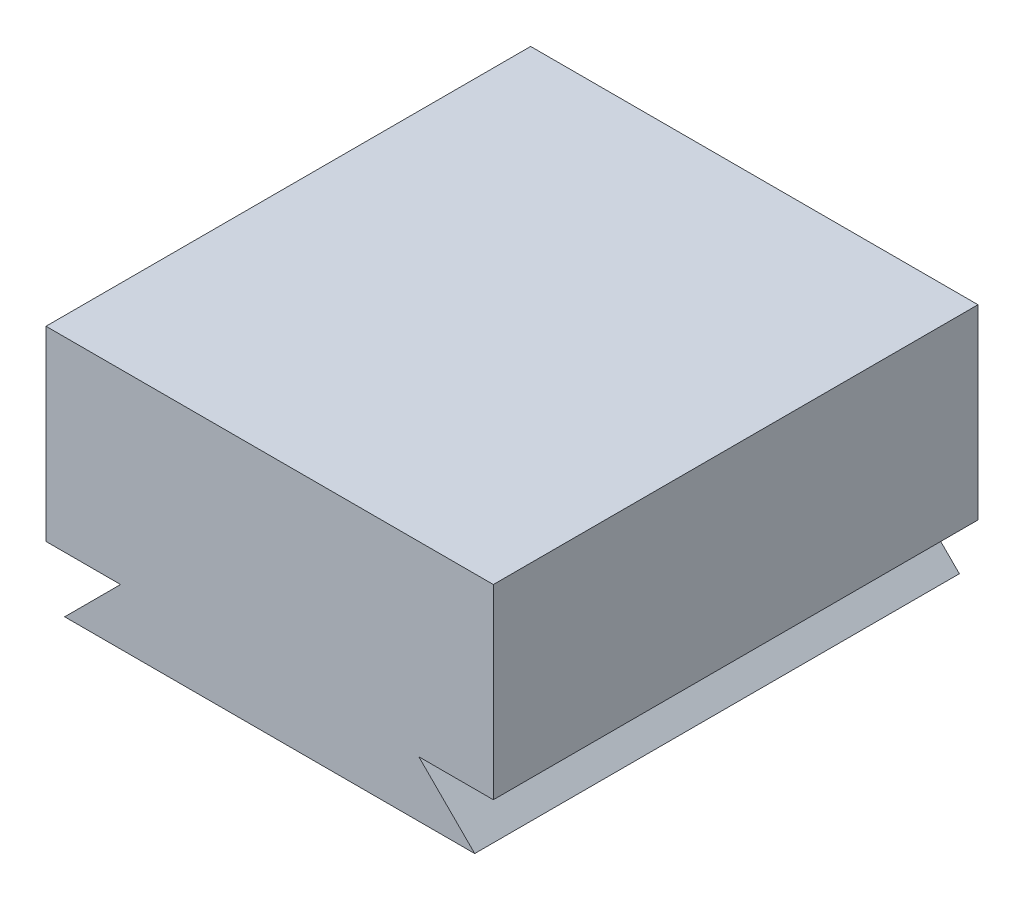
ISO-10303-21;
HEADER;
FILE_DESCRIPTION(('STEP AP214'),'2;1');
FILE_NAME('part.step','',(''),(''),'','','');
FILE_SCHEMA(('AUTOMOTIVE_DESIGN { 1 0 10303 214 1 1 1 1 }'));
ENDSEC;
DATA;
#1=APPLICATION_CONTEXT('core data for automotive mechanical design processes');
#2=APPLICATION_PROTOCOL_DEFINITION('international standard','automotive_design',2000,#1);
#3=PRODUCT_CONTEXT('',#1,'mechanical');
#4=PRODUCT('Part','Part','',(#3));
#5=PRODUCT_RELATED_PRODUCT_CATEGORY('part','',(#4));
#6=PRODUCT_DEFINITION_FORMATION('','',#4);
#7=PRODUCT_DEFINITION_CONTEXT('part definition',#1,'design');
#8=PRODUCT_DEFINITION('design','',#6,#7);
#9=PRODUCT_DEFINITION_SHAPE('','',#8);
#10=(LENGTH_UNIT() NAMED_UNIT(*) SI_UNIT(.MILLI.,.METRE.));
#11=(NAMED_UNIT(*) PLANE_ANGLE_UNIT() SI_UNIT($,.RADIAN.));
#12=(NAMED_UNIT(*) SI_UNIT($,.STERADIAN.) SOLID_ANGLE_UNIT());
#13=UNCERTAINTY_MEASURE_WITH_UNIT(LENGTH_MEASURE(1.E-05),#10,'distance_accuracy_value','');
#14=(GEOMETRIC_REPRESENTATION_CONTEXT(3) GLOBAL_UNCERTAINTY_ASSIGNED_CONTEXT((#13)) GLOBAL_UNIT_ASSIGNED_CONTEXT((#10,
#11,#12)) REPRESENTATION_CONTEXT('',''));
#15=CARTESIAN_POINT('',(0.,0.,0.));
#16=DIRECTION('',(0.,0.,1.));
#17=DIRECTION('',(1.,0.,0.));
#18=AXIS2_PLACEMENT_3D('',#15,#16,#17);
#19=CARTESIAN_POINT('',(0.,0.,26.));
#20=DIRECTION('',(1.,0.,0.));
#21=DIRECTION('',(0.,0.,-1.));
#22=AXIS2_PLACEMENT_3D('',#19,#20,#21);
#23=PLANE('',#22);
#24=DIRECTION('',(0.,-1.,0.));
#25=VECTOR('',#24,1.);
#26=CARTESIAN_POINT('',(0.,0.,0.));
#27=LINE('',#26,#25);
#28=CARTESIAN_POINT('',(0.,13.,0.));
#29=VERTEX_POINT('',#28);
#30=CARTESIAN_POINT('',(0.,3.,0.));
#31=VERTEX_POINT('',#30);
#32=EDGE_CURVE('E128',#29,#31,#27,.T.);
#33=ORIENTED_EDGE('',*,*,#32,.T.);
#34=DIRECTION('',(0.,0.,1.));
#35=VECTOR('',#34,1.);
#36=CARTESIAN_POINT('',(0.,3.,0.));
#37=LINE('',#36,#35);
#38=CARTESIAN_POINT('',(0.,3.,26.));
#39=VERTEX_POINT('',#38);
#40=EDGE_CURVE('E125',#31,#39,#37,.T.);
#41=ORIENTED_EDGE('',*,*,#40,.T.);
#42=DIRECTION('',(0.,-1.,0.));
#43=VECTOR('',#42,1.);
#44=CARTESIAN_POINT('',(0.,0.,26.));
#45=LINE('',#44,#43);
#46=CARTESIAN_POINT('',(0.,13.,26.));
#47=VERTEX_POINT('',#46);
#48=EDGE_CURVE('E141',#47,#39,#45,.T.);
#49=ORIENTED_EDGE('',*,*,#48,.F.);
#50=DIRECTION('',(0.,0.,-1.));
#51=VECTOR('',#50,1.);
#52=CARTESIAN_POINT('',(0.,13.,26.));
#53=LINE('',#52,#51);
#54=EDGE_CURVE('E31',#47,#29,#53,.T.);
#55=ORIENTED_EDGE('',*,*,#54,.T.);
#56=EDGE_LOOP('',(#33,#41,#49,#55));
#57=FACE_BOUND('',#56,.T.);
#58=ADVANCED_FACE('F24',(#57),#23,.F.);
#59=CARTESIAN_POINT('',(0.,0.,26.));
#60=DIRECTION('',(0.,1.,0.));
#61=DIRECTION('',(0.,0.,1.));
#62=AXIS2_PLACEMENT_3D('',#59,#60,#61);
#63=PLANE('',#62);
#64=DIRECTION('',(1.,0.,0.));
#65=VECTOR('',#64,1.);
#66=CARTESIAN_POINT('',(0.,0.,0.));
#67=LINE('',#66,#65);
#68=CARTESIAN_POINT('',(0.999999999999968,0.,0.));
#69=VERTEX_POINT('',#68);
#70=CARTESIAN_POINT('',(23.,0.,0.));
#71=VERTEX_POINT('',#70);
#72=EDGE_CURVE('E134',#69,#71,#67,.T.);
#73=ORIENTED_EDGE('',*,*,#72,.T.);
#74=DIRECTION('',(0.,0.,1.));
#75=VECTOR('',#74,1.);
#76=CARTESIAN_POINT('',(23.,0.,0.));
#77=LINE('',#76,#75);
#78=CARTESIAN_POINT('',(23.,0.,26.));
#79=VERTEX_POINT('',#78);
#80=EDGE_CURVE('E38',#71,#79,#77,.T.);
#81=ORIENTED_EDGE('',*,*,#80,.T.);
#82=DIRECTION('',(1.,0.,0.));
#83=VECTOR('',#82,1.);
#84=CARTESIAN_POINT('',(0.,0.,26.));
#85=LINE('',#84,#83);
#86=CARTESIAN_POINT('',(0.999999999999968,0.,26.));
#87=VERTEX_POINT('',#86);
#88=EDGE_CURVE('E107',#87,#79,#85,.T.);
#89=ORIENTED_EDGE('',*,*,#88,.F.);
#90=DIRECTION('',(0.,0.,1.));
#91=VECTOR('',#90,1.);
#92=CARTESIAN_POINT('',(0.999999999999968,0.,0.));
#93=LINE('',#92,#91);
#94=EDGE_CURVE('E124',#69,#87,#93,.T.);
#95=ORIENTED_EDGE('',*,*,#94,.F.);
#96=EDGE_LOOP('',(#73,#81,#89,#95));
#97=FACE_BOUND('',#96,.T.);
#98=ADVANCED_FACE('F164',(#97),#63,.F.);
#99=CARTESIAN_POINT('',(24.,0.,26.));
#100=DIRECTION('',(-1.,0.,0.));
#101=DIRECTION('',(0.,0.,1.));
#102=AXIS2_PLACEMENT_3D('',#99,#100,#101);
#103=PLANE('',#102);
#104=DIRECTION('',(0.,1.,0.));
#105=VECTOR('',#104,1.);
#106=CARTESIAN_POINT('',(24.,0.,26.));
#107=LINE('',#106,#105);
#108=CARTESIAN_POINT('',(24.,3.,26.));
#109=VERTEX_POINT('',#108);
#110=CARTESIAN_POINT('',(24.,13.,26.));
#111=VERTEX_POINT('',#110);
#112=EDGE_CURVE('E145',#109,#111,#107,.T.);
#113=ORIENTED_EDGE('',*,*,#112,.F.);
#114=DIRECTION('',(0.,0.,1.));
#115=VECTOR('',#114,1.);
#116=CARTESIAN_POINT('',(24.,3.,0.));
#117=LINE('',#116,#115);
#118=CARTESIAN_POINT('',(24.,3.,0.));
#119=VERTEX_POINT('',#118);
#120=EDGE_CURVE('E99',#119,#109,#117,.T.);
#121=ORIENTED_EDGE('',*,*,#120,.F.);
#122=DIRECTION('',(0.,1.,0.));
#123=VECTOR('',#122,1.);
#124=CARTESIAN_POINT('',(24.,0.,0.));
#125=LINE('',#124,#123);
#126=CARTESIAN_POINT('',(24.,13.,0.));
#127=VERTEX_POINT('',#126);
#128=EDGE_CURVE('E137',#119,#127,#125,.T.);
#129=ORIENTED_EDGE('',*,*,#128,.T.);
#130=DIRECTION('',(0.,0.,-1.));
#131=VECTOR('',#130,1.);
#132=CARTESIAN_POINT('',(24.,13.,26.));
#133=LINE('',#132,#131);
#134=EDGE_CURVE('E11',#111,#127,#133,.T.);
#135=ORIENTED_EDGE('',*,*,#134,.F.);
#136=EDGE_LOOP('',(#113,#121,#129,#135));
#137=FACE_BOUND('',#136,.T.);
#138=ADVANCED_FACE('F166',(#137),#103,.F.);
#139=CARTESIAN_POINT('',(0.,13.,26.));
#140=DIRECTION('',(0.,-1.,0.));
#141=DIRECTION('',(0.,0.,-1.));
#142=AXIS2_PLACEMENT_3D('',#139,#140,#141);
#143=PLANE('',#142);
#144=DIRECTION('',(-1.,0.,0.));
#145=VECTOR('',#144,1.);
#146=CARTESIAN_POINT('',(0.,13.,0.));
#147=LINE('',#146,#145);
#148=EDGE_CURVE('E139',#127,#29,#147,.T.);
#149=ORIENTED_EDGE('',*,*,#148,.T.);
#150=ORIENTED_EDGE('',*,*,#54,.F.);
#151=DIRECTION('',(-1.,0.,0.));
#152=VECTOR('',#151,1.);
#153=CARTESIAN_POINT('',(0.,13.,26.));
#154=LINE('',#153,#152);
#155=EDGE_CURVE('E147',#111,#47,#154,.T.);
#156=ORIENTED_EDGE('',*,*,#155,.F.);
#157=ORIENTED_EDGE('',*,*,#134,.T.);
#158=EDGE_LOOP('',(#149,#150,#156,#157));
#159=FACE_BOUND('',#158,.T.);
#160=ADVANCED_FACE('F171',(#159),#143,.F.);
#161=CARTESIAN_POINT('',(0.,13.,26.));
#162=DIRECTION('',(0.,0.,-1.));
#163=DIRECTION('',(-1.,0.,0.));
#164=AXIS2_PLACEMENT_3D('',#161,#162,#163);
#165=PLANE('',#164);
#166=DIRECTION('',(0.707106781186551,-0.707106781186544,0.));
#167=VECTOR('',#166,1.);
#168=CARTESIAN_POINT('',(23.,0.,26.));
#169=LINE('',#168,#167);
#170=CARTESIAN_POINT('',(20.,3.,26.));
#171=VERTEX_POINT('',#170);
#172=EDGE_CURVE('E90',#171,#79,#169,.T.);
#173=ORIENTED_EDGE('',*,*,#172,.F.);
#174=DIRECTION('',(-1.,0.,0.));
#175=VECTOR('',#174,1.);
#176=CARTESIAN_POINT('',(20.,3.,26.));
#177=LINE('',#176,#175);
#178=EDGE_CURVE('E96',#109,#171,#177,.T.);
#179=ORIENTED_EDGE('',*,*,#178,.F.);
#180=ORIENTED_EDGE('',*,*,#112,.T.);
#181=ORIENTED_EDGE('',*,*,#155,.T.);
#182=ORIENTED_EDGE('',*,*,#48,.T.);
#183=DIRECTION('',(-1.,0.,0.));
#184=VECTOR('',#183,1.);
#185=CARTESIAN_POINT('',(4.,3.,26.));
#186=LINE('',#185,#184);
#187=CARTESIAN_POINT('',(4.,3.,26.));
#188=VERTEX_POINT('',#187);
#189=EDGE_CURVE('E118',#188,#39,#186,.T.);
#190=ORIENTED_EDGE('',*,*,#189,.F.);
#191=DIRECTION('',(0.707106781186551,0.707106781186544,0.));
#192=VECTOR('',#191,1.);
#193=CARTESIAN_POINT('',(0.999999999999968,0.,26.));
#194=LINE('',#193,#192);
#195=EDGE_CURVE('E114',#87,#188,#194,.T.);
#196=ORIENTED_EDGE('',*,*,#195,.F.);
#197=ORIENTED_EDGE('',*,*,#88,.T.);
#198=EDGE_LOOP('',(#173,#179,#180,#181,#182,#190,#196,#197));
#199=FACE_BOUND('',#198,.T.);
#200=ADVANCED_FACE('F104',(#199),#165,.F.);
#201=CARTESIAN_POINT('',(0.,13.,0.));
#202=DIRECTION('',(0.,0.,-1.));
#203=DIRECTION('',(-1.,0.,0.));
#204=AXIS2_PLACEMENT_3D('',#201,#202,#203);
#205=PLANE('',#204);
#206=DIRECTION('',(-1.,0.,0.));
#207=VECTOR('',#206,1.);
#208=CARTESIAN_POINT('',(20.,3.,0.));
#209=LINE('',#208,#207);
#210=CARTESIAN_POINT('',(20.,3.,0.));
#211=VERTEX_POINT('',#210);
#212=EDGE_CURVE('E108',#119,#211,#209,.T.);
#213=ORIENTED_EDGE('',*,*,#212,.T.);
#214=DIRECTION('',(0.707106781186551,-0.707106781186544,0.));
#215=VECTOR('',#214,1.);
#216=CARTESIAN_POINT('',(23.,0.,0.));
#217=LINE('',#216,#215);
#218=EDGE_CURVE('E91',#211,#71,#217,.T.);
#219=ORIENTED_EDGE('',*,*,#218,.T.);
#220=ORIENTED_EDGE('',*,*,#72,.F.);
#221=DIRECTION('',(0.707106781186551,0.707106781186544,0.));
#222=VECTOR('',#221,1.);
#223=CARTESIAN_POINT('',(0.999999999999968,0.,0.));
#224=LINE('',#223,#222);
#225=CARTESIAN_POINT('',(4.,3.,0.));
#226=VERTEX_POINT('',#225);
#227=EDGE_CURVE('E120',#69,#226,#224,.T.);
#228=ORIENTED_EDGE('',*,*,#227,.T.);
#229=DIRECTION('',(-1.,0.,0.));
#230=VECTOR('',#229,1.);
#231=CARTESIAN_POINT('',(4.,3.,0.));
#232=LINE('',#231,#230);
#233=EDGE_CURVE('E46',#226,#31,#232,.T.);
#234=ORIENTED_EDGE('',*,*,#233,.T.);
#235=ORIENTED_EDGE('',*,*,#32,.F.);
#236=ORIENTED_EDGE('',*,*,#148,.F.);
#237=ORIENTED_EDGE('',*,*,#128,.F.);
#238=EDGE_LOOP('',(#213,#219,#220,#228,#234,#235,#236,#237));
#239=FACE_BOUND('',#238,.T.);
#240=ADVANCED_FACE('F157',(#239),#205,.T.);
#241=CARTESIAN_POINT('',(4.,3.,0.));
#242=DIRECTION('',(0.,1.,0.));
#243=DIRECTION('',(-1.,0.,0.));
#244=AXIS2_PLACEMENT_3D('',#241,#242,#243);
#245=PLANE('',#244);
#246=ORIENTED_EDGE('',*,*,#189,.T.);
#247=ORIENTED_EDGE('',*,*,#40,.F.);
#248=ORIENTED_EDGE('',*,*,#233,.F.);
#249=DIRECTION('',(0.,0.,1.));
#250=VECTOR('',#249,1.);
#251=CARTESIAN_POINT('',(4.,3.,0.));
#252=LINE('',#251,#250);
#253=EDGE_CURVE('E129',#226,#188,#252,.T.);
#254=ORIENTED_EDGE('',*,*,#253,.T.);
#255=EDGE_LOOP('',(#246,#247,#248,#254));
#256=FACE_BOUND('',#255,.T.);
#257=ADVANCED_FACE('F181',(#256),#245,.F.);
#258=CARTESIAN_POINT('',(0.999999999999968,0.,0.));
#259=DIRECTION('',(0.707106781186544,-0.707106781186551,0.));
#260=DIRECTION('',(0.707106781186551,0.707106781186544,0.));
#261=AXIS2_PLACEMENT_3D('',#258,#259,#260);
#262=PLANE('',#261);
#263=ORIENTED_EDGE('',*,*,#195,.T.);
#264=ORIENTED_EDGE('',*,*,#253,.F.);
#265=ORIENTED_EDGE('',*,*,#227,.F.);
#266=ORIENTED_EDGE('',*,*,#94,.T.);
#267=EDGE_LOOP('',(#263,#264,#265,#266));
#268=FACE_BOUND('',#267,.T.);
#269=ADVANCED_FACE('F162',(#268),#262,.F.);
#270=CARTESIAN_POINT('',(20.,3.,0.));
#271=DIRECTION('',(0.,1.,0.));
#272=DIRECTION('',(-1.,0.,0.));
#273=AXIS2_PLACEMENT_3D('',#270,#271,#272);
#274=PLANE('',#273);
#275=ORIENTED_EDGE('',*,*,#178,.T.);
#276=DIRECTION('',(0.,0.,1.));
#277=VECTOR('',#276,1.);
#278=CARTESIAN_POINT('',(20.,3.,0.));
#279=LINE('',#278,#277);
#280=EDGE_CURVE('E86',#211,#171,#279,.T.);
#281=ORIENTED_EDGE('',*,*,#280,.F.);
#282=ORIENTED_EDGE('',*,*,#212,.F.);
#283=ORIENTED_EDGE('',*,*,#120,.T.);
#284=EDGE_LOOP('',(#275,#281,#282,#283));
#285=FACE_BOUND('',#284,.T.);
#286=ADVANCED_FACE('F97',(#285),#274,.F.);
#287=CARTESIAN_POINT('',(23.,0.,0.));
#288=DIRECTION('',(-0.707106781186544,-0.707106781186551,0.));
#289=DIRECTION('',(0.707106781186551,-0.707106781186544,0.));
#290=AXIS2_PLACEMENT_3D('',#287,#288,#289);
#291=PLANE('',#290);
#292=ORIENTED_EDGE('',*,*,#172,.T.);
#293=ORIENTED_EDGE('',*,*,#80,.F.);
#294=ORIENTED_EDGE('',*,*,#218,.F.);
#295=ORIENTED_EDGE('',*,*,#280,.T.);
#296=EDGE_LOOP('',(#292,#293,#294,#295));
#297=FACE_BOUND('',#296,.T.);
#298=ADVANCED_FACE('F88',(#297),#291,.F.);
#299=CLOSED_SHELL('',(#58,#98,#138,#160,#200,#240,#257,#269,#286,#298));
#300=MANIFOLD_SOLID_BREP('B2',#299);
#301=ADVANCED_BREP_SHAPE_REPRESENTATION('',(#18,#300),#14);
#302=SHAPE_DEFINITION_REPRESENTATION(#9,#301);
ENDSEC;
END-ISO-10303-21;
